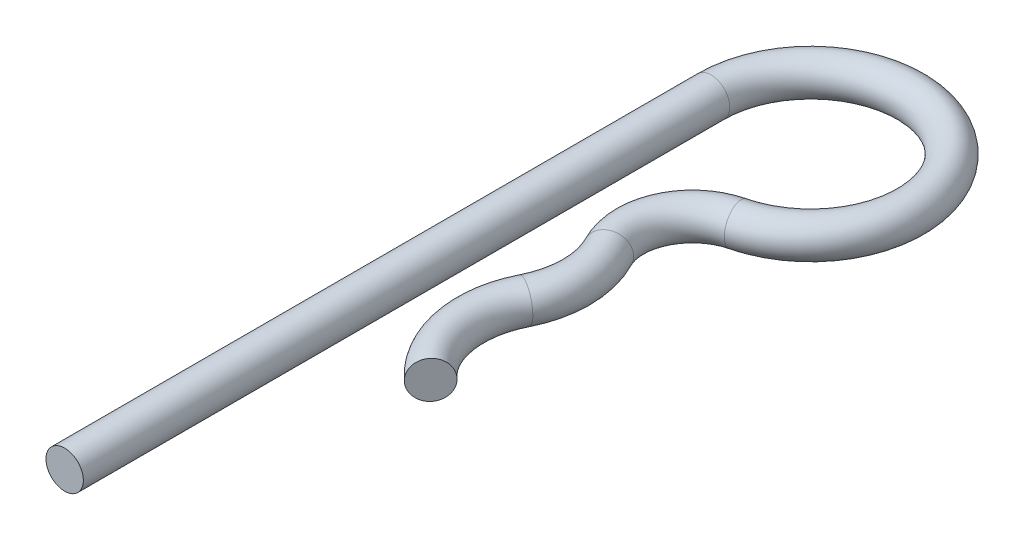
ISO-10303-21;
HEADER;
FILE_DESCRIPTION(('STEP AP214'),'2;1');
FILE_NAME('part.step','',(''),(''),'','','');
FILE_SCHEMA(('AUTOMOTIVE_DESIGN { 1 0 10303 214 1 1 1 1 }'));
ENDSEC;
DATA;
#1=APPLICATION_CONTEXT('core data for automotive mechanical design processes');
#2=APPLICATION_PROTOCOL_DEFINITION('international standard','automotive_design',2000,#1);
#3=PRODUCT_CONTEXT('',#1,'mechanical');
#4=PRODUCT('Part','Part','',(#3));
#5=PRODUCT_RELATED_PRODUCT_CATEGORY('part','',(#4));
#6=PRODUCT_DEFINITION_FORMATION('','',#4);
#7=PRODUCT_DEFINITION_CONTEXT('part definition',#1,'design');
#8=PRODUCT_DEFINITION('design','',#6,#7);
#9=PRODUCT_DEFINITION_SHAPE('','',#8);
#10=(LENGTH_UNIT() NAMED_UNIT(*) SI_UNIT(.MILLI.,.METRE.));
#11=(NAMED_UNIT(*) PLANE_ANGLE_UNIT() SI_UNIT($,.RADIAN.));
#12=(NAMED_UNIT(*) SI_UNIT($,.STERADIAN.) SOLID_ANGLE_UNIT());
#13=UNCERTAINTY_MEASURE_WITH_UNIT(LENGTH_MEASURE(1.E-05),#10,'distance_accuracy_value','');
#14=(GEOMETRIC_REPRESENTATION_CONTEXT(3) GLOBAL_UNCERTAINTY_ASSIGNED_CONTEXT((#13)) GLOBAL_UNIT_ASSIGNED_CONTEXT((#10,
#11,#12)) REPRESENTATION_CONTEXT('',''));
#15=CARTESIAN_POINT('',(0.,0.,0.));
#16=DIRECTION('',(0.,0.,1.));
#17=DIRECTION('',(1.,0.,0.));
#18=AXIS2_PLACEMENT_3D('',#15,#16,#17);
#19=CARTESIAN_POINT('',(13.6717940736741,0.,-26.6979589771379));
#20=DIRECTION('',(0.,1.,0.));
#21=DIRECTION('',(0.,0.,1.));
#22=AXIS2_PLACEMENT_3D('',#19,#20,#21);
#23=TOROIDAL_SURFACE('',#22,7.78964802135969,1.5);
#24=CARTESIAN_POINT('',(6.70639738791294,0.,-30.1853455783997));
#25=DIRECTION('',(0.447695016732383,0.,-0.894186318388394));
#26=DIRECTION('',(-0.894186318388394,0.,-0.447695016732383));
#27=AXIS2_PLACEMENT_3D('',#24,#25,#26);
#28=CIRCLE('',#27,1.5);
#29=CARTESIAN_POINT('',(5.36511791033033,0.,-30.8568881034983));
#30=VERTEX_POINT('',#29);
#31=EDGE_CURVE('E35',#30,#30,#28,.T.);
#32=CARTESIAN_POINT('',(8.44709315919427,0.,-20.9203196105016));
#33=DIRECTION('',(-0.74170737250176,0.,-0.670723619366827));
#34=DIRECTION('',(-0.670723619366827,0.,0.74170737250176));
#35=AXIS2_PLACEMENT_3D('',#32,#33,#34);
#36=CIRCLE('',#35,1.5);
#37=CARTESIAN_POINT('',(7.44100773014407,0.,-19.8077585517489));
#38=VERTEX_POINT('',#37);
#39=EDGE_CURVE('E10',#38,#38,#36,.T.);
#40=CARTESIAN_POINT('',(13.6717940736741,0.,-26.6979589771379));
#41=DIRECTION('',(0.,1.,0.));
#42=DIRECTION('',(0.,0.,1.));
#43=AXIS2_PLACEMENT_3D('',#40,#41,#42);
#44=CIRCLE('',#43,9.28964802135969);
#45=EDGE_CURVE('',#30,#38,#44,.T.);
#46=ORIENTED_EDGE('',*,*,#31,.F.);
#47=ORIENTED_EDGE('',*,*,#39,.T.);
#48=ORIENTED_EDGE('',*,*,#45,.T.);
#49=ORIENTED_EDGE('',*,*,#45,.F.);
#50=EDGE_LOOP('',(#46,#48,#47,#49));
#51=FACE_BOUND('',#50,.T.);
#52=ADVANCED_FACE('F29',(#51),#23,.T.);
#53=CARTESIAN_POINT('',(0.,0.,-33.5430582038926));
#54=DIRECTION('',(0.,-1.,0.));
#55=DIRECTION('',(0.,0.,-1.));
#56=AXIS2_PLACEMENT_3D('',#53,#54,#55);
#57=TOROIDAL_SURFACE('',#56,7.5,1.5);
#58=CARTESIAN_POINT('',(6.67453371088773,0.,-36.9636721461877));
#59=DIRECTION('',(-0.456081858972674,0.,-0.889937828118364));
#60=DIRECTION('',(-0.889937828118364,0.,0.456081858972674));
#61=AXIS2_PLACEMENT_3D('',#58,#59,#60);
#62=CIRCLE('',#61,1.5);
#63=CARTESIAN_POINT('',(5.33962696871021,0.,-36.2795493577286));
#64=VERTEX_POINT('',#63);
#65=EDGE_CURVE('E39',#64,#64,#62,.T.);
#66=ORIENTED_EDGE('',*,*,#65,.F.);
#67=EDGE_LOOP('',(#66));
#68=FACE_BOUND('',#67,.T.);
#69=ORIENTED_EDGE('',*,*,#31,.T.);
#70=EDGE_LOOP('',(#69));
#71=FACE_BOUND('',#70,.T.);
#72=ADVANCED_FACE('F67',(#68,#71),#57,.T.);
#73=CARTESIAN_POINT('',(11.1242228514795,0.,-39.2440814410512));
#74=DIRECTION('',(0.,1.,0.));
#75=DIRECTION('',(0.,0.,1.));
#76=AXIS2_PLACEMENT_3D('',#73,#74,#75);
#77=TOROIDAL_SURFACE('',#76,5.,1.5);
#78=CARTESIAN_POINT('',(9.92259867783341,0.,-44.097544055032));
#79=DIRECTION('',(0.970692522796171,0.,-0.240324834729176));
#80=DIRECTION('',(-0.240324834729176,0.,-0.970692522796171));
#81=AXIS2_PLACEMENT_3D('',#78,#79,#80);
#82=CIRCLE('',#81,1.5);
#83=CARTESIAN_POINT('',(9.56211142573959,0.,-45.5535828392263));
#84=VERTEX_POINT('',#83);
#85=EDGE_CURVE('E43',#84,#84,#82,.T.);
#86=CARTESIAN_POINT('',(11.1242228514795,0.,-39.2440814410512));
#87=DIRECTION('',(0.,1.,0.));
#88=DIRECTION('',(0.,0.,1.));
#89=AXIS2_PLACEMENT_3D('',#86,#87,#88);
#90=CIRCLE('',#89,6.5);
#91=EDGE_CURVE('',#84,#64,#90,.T.);
#92=ORIENTED_EDGE('',*,*,#85,.F.);
#93=ORIENTED_EDGE('',*,*,#65,.T.);
#94=ORIENTED_EDGE('',*,*,#91,.T.);
#95=ORIENTED_EDGE('',*,*,#91,.F.);
#96=EDGE_LOOP('',(#92,#94,#93,#95));
#97=FACE_BOUND('',#96,.T.);
#98=ADVANCED_FACE('F61',(#97),#77,.T.);
#99=CARTESIAN_POINT('',(8.,0.,-51.8630842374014));
#100=DIRECTION('',(0.,-1.,0.));
#101=DIRECTION('',(0.,0.,-1.));
#102=AXIS2_PLACEMENT_3D('',#99,#100,#101);
#103=TOROIDAL_SURFACE('',#102,8.,1.5);
#104=CARTESIAN_POINT('',(0.,0.,-51.8630842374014));
#105=DIRECTION('',(0.,0.,1.));
#106=DIRECTION('',(1.,0.,0.));
#107=AXIS2_PLACEMENT_3D('',#104,#105,#106);
#108=CIRCLE('',#107,1.5);
#109=CARTESIAN_POINT('',(1.5,0.,-51.8630842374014));
#110=VERTEX_POINT('',#109);
#111=EDGE_CURVE('E48',#110,#110,#108,.T.);
#112=ORIENTED_EDGE('',*,*,#111,.F.);
#113=EDGE_LOOP('',(#112));
#114=FACE_BOUND('',#113,.T.);
#115=ORIENTED_EDGE('',*,*,#85,.T.);
#116=EDGE_LOOP('',(#115));
#117=FACE_BOUND('',#116,.T.);
#118=ADVANCED_FACE('F58',(#114,#117),#103,.T.);
#119=CARTESIAN_POINT('',(0.,0.,-51.8630842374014));
#120=DIRECTION('',(0.,0.,1.));
#121=DIRECTION('',(1.,0.,0.));
#122=AXIS2_PLACEMENT_3D('',#119,#120,#121);
#123=CYLINDRICAL_SURFACE('',#122,1.5);
#124=ORIENTED_EDGE('',*,*,#111,.T.);
#125=EDGE_LOOP('',(#124));
#126=FACE_BOUND('',#125,.T.);
#127=CARTESIAN_POINT('',(0.,0.,0.));
#128=DIRECTION('',(0.,0.,1.));
#129=DIRECTION('',(1.,0.,0.));
#130=AXIS2_PLACEMENT_3D('',#127,#128,#129);
#131=CIRCLE('',#130,1.5);
#132=CARTESIAN_POINT('',(1.5,0.,0.));
#133=VERTEX_POINT('',#132);
#134=EDGE_CURVE('E49',#133,#133,#131,.T.);
#135=ORIENTED_EDGE('',*,*,#134,.F.);
#136=EDGE_LOOP('',(#135));
#137=FACE_BOUND('',#136,.T.);
#138=ADVANCED_FACE('F55',(#126,#137),#123,.T.);
#139=CARTESIAN_POINT('',(8.44709315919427,0.,-20.9203196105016));
#140=DIRECTION('',(-0.74170737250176,0.,-0.670723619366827));
#141=DIRECTION('',(-0.670723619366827,0.,0.74170737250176));
#142=AXIS2_PLACEMENT_3D('',#139,#140,#141);
#143=PLANE('',#142);
#144=ORIENTED_EDGE('',*,*,#39,.F.);
#145=EDGE_LOOP('',(#144));
#146=FACE_BOUND('',#145,.T.);
#147=ADVANCED_FACE('F79',(#146),#143,.F.);
#148=CARTESIAN_POINT('',(0.,0.,0.));
#149=DIRECTION('',(0.,0.,1.));
#150=DIRECTION('',(1.,0.,0.));
#151=AXIS2_PLACEMENT_3D('',#148,#149,#150);
#152=PLANE('',#151);
#153=ORIENTED_EDGE('',*,*,#134,.T.);
#154=EDGE_LOOP('',(#153));
#155=FACE_BOUND('',#154,.T.);
#156=ADVANCED_FACE('F80',(#155),#152,.T.);
#157=CLOSED_SHELL('',(#52,#72,#98,#118,#138,#147,#156));
#158=MANIFOLD_SOLID_BREP('B2',#157);
#159=ADVANCED_BREP_SHAPE_REPRESENTATION('',(#18,#158),#14);
#160=SHAPE_DEFINITION_REPRESENTATION(#9,#159);
ENDSEC;
END-ISO-10303-21;
